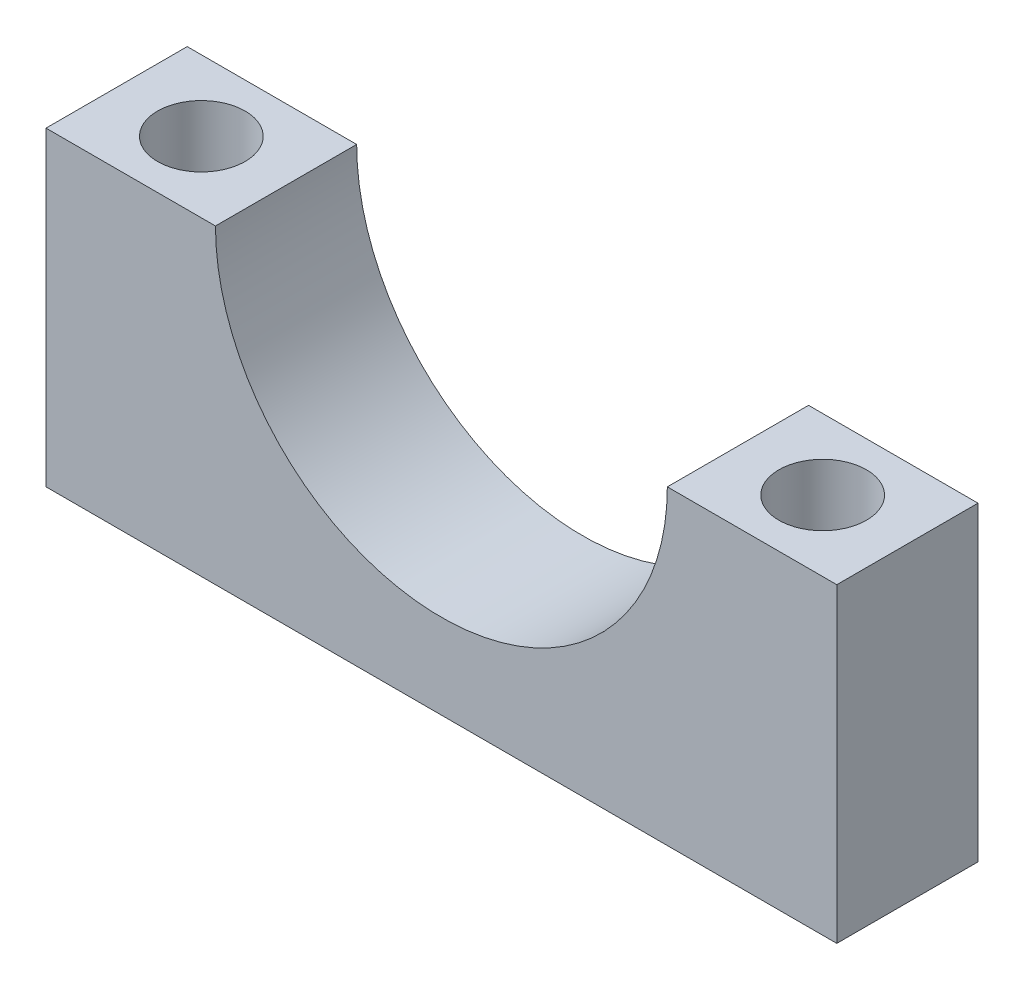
ISO-10303-21;
HEADER;
FILE_DESCRIPTION(('STEP AP214'),'2;1');
FILE_NAME('part.step','',(''),(''),'','','');
FILE_SCHEMA(('AUTOMOTIVE_DESIGN { 1 0 10303 214 1 1 1 1 }'));
ENDSEC;
DATA;
#1=APPLICATION_CONTEXT('core data for automotive mechanical design processes');
#2=APPLICATION_PROTOCOL_DEFINITION('international standard','automotive_design',2000,#1);
#3=PRODUCT_CONTEXT('',#1,'mechanical');
#4=PRODUCT('Part','Part','',(#3));
#5=PRODUCT_RELATED_PRODUCT_CATEGORY('part','',(#4));
#6=PRODUCT_DEFINITION_FORMATION('','',#4);
#7=PRODUCT_DEFINITION_CONTEXT('part definition',#1,'design');
#8=PRODUCT_DEFINITION('design','',#6,#7);
#9=PRODUCT_DEFINITION_SHAPE('','',#8);
#10=(LENGTH_UNIT() NAMED_UNIT(*) SI_UNIT(.MILLI.,.METRE.));
#11=(NAMED_UNIT(*) PLANE_ANGLE_UNIT() SI_UNIT($,.RADIAN.));
#12=(NAMED_UNIT(*) SI_UNIT($,.STERADIAN.) SOLID_ANGLE_UNIT());
#13=UNCERTAINTY_MEASURE_WITH_UNIT(LENGTH_MEASURE(1.E-05),#10,'distance_accuracy_value','');
#14=(GEOMETRIC_REPRESENTATION_CONTEXT(3) GLOBAL_UNCERTAINTY_ASSIGNED_CONTEXT((#13)) GLOBAL_UNIT_ASSIGNED_CONTEXT((#10,
#11,#12)) REPRESENTATION_CONTEXT('',''));
#15=CARTESIAN_POINT('',(0.,0.,0.));
#16=DIRECTION('',(0.,0.,1.));
#17=DIRECTION('',(1.,0.,0.));
#18=AXIS2_PLACEMENT_3D('',#15,#16,#17);
#19=CARTESIAN_POINT('',(14.,-5.5,5.));
#20=DIRECTION('',(-1.,0.,0.));
#21=DIRECTION('',(0.,0.,1.));
#22=AXIS2_PLACEMENT_3D('',#19,#20,#21);
#23=PLANE('',#22);
#24=DIRECTION('',(0.,1.,0.));
#25=VECTOR('',#24,1.);
#26=CARTESIAN_POINT('',(14.,-5.5,0.));
#27=LINE('',#26,#25);
#28=CARTESIAN_POINT('',(14.,-5.5,0.));
#29=VERTEX_POINT('',#28);
#30=CARTESIAN_POINT('',(14.,5.5,0.));
#31=VERTEX_POINT('',#30);
#32=EDGE_CURVE('E128',#29,#31,#27,.T.);
#33=ORIENTED_EDGE('',*,*,#32,.T.);
#34=DIRECTION('',(0.,0.,-1.));
#35=VECTOR('',#34,1.);
#36=CARTESIAN_POINT('',(14.,5.5,5.));
#37=LINE('',#36,#35);
#38=CARTESIAN_POINT('',(14.,5.5,5.));
#39=VERTEX_POINT('',#38);
#40=EDGE_CURVE('E11',#39,#31,#37,.T.);
#41=ORIENTED_EDGE('',*,*,#40,.F.);
#42=DIRECTION('',(0.,1.,0.));
#43=VECTOR('',#42,1.);
#44=CARTESIAN_POINT('',(14.,-5.5,5.));
#45=LINE('',#44,#43);
#46=CARTESIAN_POINT('',(14.,-5.5,5.));
#47=VERTEX_POINT('',#46);
#48=EDGE_CURVE('E145',#47,#39,#45,.T.);
#49=ORIENTED_EDGE('',*,*,#48,.F.);
#50=DIRECTION('',(0.,0.,-1.));
#51=VECTOR('',#50,1.);
#52=CARTESIAN_POINT('',(14.,-5.5,5.));
#53=LINE('',#52,#51);
#54=EDGE_CURVE('E124',#47,#29,#53,.T.);
#55=ORIENTED_EDGE('',*,*,#54,.T.);
#56=EDGE_LOOP('',(#33,#41,#49,#55));
#57=FACE_BOUND('',#56,.T.);
#58=ADVANCED_FACE('F39',(#57),#23,.F.);
#59=CARTESIAN_POINT('',(14.,5.5,5.));
#60=DIRECTION('',(0.,-1.,0.));
#61=DIRECTION('',(0.,0.,-1.));
#62=AXIS2_PLACEMENT_3D('',#59,#60,#61);
#63=PLANE('',#62);
#64=CARTESIAN_POINT('',(11.,5.5,2.5));
#65=DIRECTION('',(0.,-1.,0.));
#66=DIRECTION('',(0.,0.,-1.));
#67=AXIS2_PLACEMENT_3D('',#64,#65,#66);
#68=CIRCLE('',#67,1.55);
#69=CARTESIAN_POINT('',(11.,5.5,0.950000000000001));
#70=VERTEX_POINT('',#69);
#71=EDGE_CURVE('E199',#70,#70,#68,.T.);
#72=ORIENTED_EDGE('',*,*,#71,.T.);
#73=EDGE_LOOP('',(#72));
#74=FACE_BOUND('',#73,.T.);
#75=DIRECTION('',(-1.,0.,0.));
#76=VECTOR('',#75,1.);
#77=CARTESIAN_POINT('',(14.,5.5,0.));
#78=LINE('',#77,#76);
#79=CARTESIAN_POINT('',(8.,5.5,0.));
#80=VERTEX_POINT('',#79);
#81=EDGE_CURVE('E132',#31,#80,#78,.T.);
#82=ORIENTED_EDGE('',*,*,#81,.T.);
#83=DIRECTION('',(0.,0.,-1.));
#84=VECTOR('',#83,1.);
#85=CARTESIAN_POINT('',(8.,5.5,5.));
#86=LINE('',#85,#84);
#87=CARTESIAN_POINT('',(8.,5.5,5.));
#88=VERTEX_POINT('',#87);
#89=EDGE_CURVE('E48',#88,#80,#86,.T.);
#90=ORIENTED_EDGE('',*,*,#89,.F.);
#91=DIRECTION('',(-1.,0.,0.));
#92=VECTOR('',#91,1.);
#93=CARTESIAN_POINT('',(14.,5.5,5.));
#94=LINE('',#93,#92);
#95=EDGE_CURVE('E93',#39,#88,#94,.T.);
#96=ORIENTED_EDGE('',*,*,#95,.F.);
#97=ORIENTED_EDGE('',*,*,#40,.T.);
#98=EDGE_LOOP('',(#82,#90,#96,#97));
#99=FACE_BOUND('',#98,.T.);
#100=ADVANCED_FACE('F176',(#74,#99),#63,.F.);
#101=CARTESIAN_POINT('',(0.,5.5,5.));
#102=DIRECTION('',(0.,0.,-1.));
#103=DIRECTION('',(-1.,0.,0.));
#104=AXIS2_PLACEMENT_3D('',#101,#102,#103);
#105=CYLINDRICAL_SURFACE('',#104,8.);
#106=CARTESIAN_POINT('',(0.,5.5,0.));
#107=DIRECTION('',(0.,0.,-1.));
#108=DIRECTION('',(-1.,0.,0.));
#109=AXIS2_PLACEMENT_3D('',#106,#107,#108);
#110=CIRCLE('',#109,8.);
#111=CARTESIAN_POINT('',(-8.,5.5,0.));
#112=VERTEX_POINT('',#111);
#113=EDGE_CURVE('E136',#80,#112,#110,.T.);
#114=ORIENTED_EDGE('',*,*,#113,.T.);
#115=DIRECTION('',(0.,0.,-1.));
#116=VECTOR('',#115,1.);
#117=CARTESIAN_POINT('',(-8.,5.5,5.));
#118=LINE('',#117,#116);
#119=CARTESIAN_POINT('',(-8.,5.5,5.));
#120=VERTEX_POINT('',#119);
#121=EDGE_CURVE('E117',#120,#112,#118,.T.);
#122=ORIENTED_EDGE('',*,*,#121,.F.);
#123=CARTESIAN_POINT('',(0.,5.5,5.));
#124=DIRECTION('',(0.,0.,-1.));
#125=DIRECTION('',(-1.,0.,0.));
#126=AXIS2_PLACEMENT_3D('',#123,#124,#125);
#127=CIRCLE('',#126,8.);
#128=EDGE_CURVE('E106',#88,#120,#127,.T.);
#129=ORIENTED_EDGE('',*,*,#128,.F.);
#130=ORIENTED_EDGE('',*,*,#89,.T.);
#131=EDGE_LOOP('',(#114,#122,#129,#130));
#132=FACE_BOUND('',#131,.T.);
#133=ADVANCED_FACE('F155',(#132),#105,.F.);
#134=CARTESIAN_POINT('',(-8.,5.5,5.));
#135=DIRECTION('',(0.,-1.,0.));
#136=DIRECTION('',(0.,0.,-1.));
#137=AXIS2_PLACEMENT_3D('',#134,#135,#136);
#138=PLANE('',#137);
#139=CARTESIAN_POINT('',(-11.,5.5,2.5));
#140=DIRECTION('',(0.,-1.,0.));
#141=DIRECTION('',(0.,0.,-1.));
#142=AXIS2_PLACEMENT_3D('',#139,#140,#141);
#143=CIRCLE('',#142,1.55);
#144=CARTESIAN_POINT('',(-11.,5.5,0.950000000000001));
#145=VERTEX_POINT('',#144);
#146=EDGE_CURVE('E133',#145,#145,#143,.T.);
#147=ORIENTED_EDGE('',*,*,#146,.T.);
#148=EDGE_LOOP('',(#147));
#149=FACE_BOUND('',#148,.T.);
#150=DIRECTION('',(-1.,0.,0.));
#151=VECTOR('',#150,1.);
#152=CARTESIAN_POINT('',(-8.,5.5,0.));
#153=LINE('',#152,#151);
#154=CARTESIAN_POINT('',(-14.,5.5,0.));
#155=VERTEX_POINT('',#154);
#156=EDGE_CURVE('E115',#112,#155,#153,.T.);
#157=ORIENTED_EDGE('',*,*,#156,.T.);
#158=DIRECTION('',(0.,0.,-1.));
#159=VECTOR('',#158,1.);
#160=CARTESIAN_POINT('',(-14.,5.5,5.));
#161=LINE('',#160,#159);
#162=CARTESIAN_POINT('',(-14.,5.5,5.));
#163=VERTEX_POINT('',#162);
#164=EDGE_CURVE('E112',#163,#155,#161,.T.);
#165=ORIENTED_EDGE('',*,*,#164,.F.);
#166=DIRECTION('',(-1.,0.,0.));
#167=VECTOR('',#166,1.);
#168=CARTESIAN_POINT('',(-8.,5.5,5.));
#169=LINE('',#168,#167);
#170=EDGE_CURVE('E100',#120,#163,#169,.T.);
#171=ORIENTED_EDGE('',*,*,#170,.F.);
#172=ORIENTED_EDGE('',*,*,#121,.T.);
#173=EDGE_LOOP('',(#157,#165,#171,#172));
#174=FACE_BOUND('',#173,.T.);
#175=ADVANCED_FACE('F113',(#149,#174),#138,.F.);
#176=CARTESIAN_POINT('',(-14.,5.5,5.));
#177=DIRECTION('',(1.,0.,0.));
#178=DIRECTION('',(0.,1.,0.));
#179=AXIS2_PLACEMENT_3D('',#176,#177,#178);
#180=PLANE('',#179);
#181=DIRECTION('',(0.,-1.,0.));
#182=VECTOR('',#181,1.);
#183=CARTESIAN_POINT('',(-14.,5.5,0.));
#184=LINE('',#183,#182);
#185=CARTESIAN_POINT('',(-14.,-5.5,0.));
#186=VERTEX_POINT('',#185);
#187=EDGE_CURVE('E79',#155,#186,#184,.T.);
#188=ORIENTED_EDGE('',*,*,#187,.T.);
#189=DIRECTION('',(0.,0.,-1.));
#190=VECTOR('',#189,1.);
#191=CARTESIAN_POINT('',(-14.,-5.5,5.));
#192=LINE('',#191,#190);
#193=CARTESIAN_POINT('',(-14.,-5.5,5.));
#194=VERTEX_POINT('',#193);
#195=EDGE_CURVE('E118',#194,#186,#192,.T.);
#196=ORIENTED_EDGE('',*,*,#195,.F.);
#197=DIRECTION('',(0.,-1.,0.));
#198=VECTOR('',#197,1.);
#199=CARTESIAN_POINT('',(-14.,5.5,5.));
#200=LINE('',#199,#198);
#201=EDGE_CURVE('E104',#163,#194,#200,.T.);
#202=ORIENTED_EDGE('',*,*,#201,.F.);
#203=ORIENTED_EDGE('',*,*,#164,.T.);
#204=EDGE_LOOP('',(#188,#196,#202,#203));
#205=FACE_BOUND('',#204,.T.);
#206=ADVANCED_FACE('F120',(#205),#180,.F.);
#207=CARTESIAN_POINT('',(-14.,-5.5,5.));
#208=DIRECTION('',(0.,1.,0.));
#209=DIRECTION('',(0.,0.,1.));
#210=AXIS2_PLACEMENT_3D('',#207,#208,#209);
#211=PLANE('',#210);
#212=CARTESIAN_POINT('',(-11.,-5.5,2.5));
#213=DIRECTION('',(0.,-1.,0.));
#214=DIRECTION('',(0.,0.,-1.));
#215=AXIS2_PLACEMENT_3D('',#212,#213,#214);
#216=CIRCLE('',#215,1.55);
#217=CARTESIAN_POINT('',(-11.,-5.5,0.950000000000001));
#218=VERTEX_POINT('',#217);
#219=EDGE_CURVE('E195',#218,#218,#216,.T.);
#220=ORIENTED_EDGE('',*,*,#219,.F.);
#221=EDGE_LOOP('',(#220));
#222=FACE_BOUND('',#221,.T.);
#223=CARTESIAN_POINT('',(11.,-5.5,2.5));
#224=DIRECTION('',(0.,-1.,0.));
#225=DIRECTION('',(0.,0.,-1.));
#226=AXIS2_PLACEMENT_3D('',#223,#224,#225);
#227=CIRCLE('',#226,1.55);
#228=CARTESIAN_POINT('',(11.,-5.5,0.950000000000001));
#229=VERTEX_POINT('',#228);
#230=EDGE_CURVE('E204',#229,#229,#227,.T.);
#231=ORIENTED_EDGE('',*,*,#230,.F.);
#232=EDGE_LOOP('',(#231));
#233=FACE_BOUND('',#232,.T.);
#234=DIRECTION('',(1.,0.,0.));
#235=VECTOR('',#234,1.);
#236=CARTESIAN_POINT('',(-14.,-5.5,0.));
#237=LINE('',#236,#235);
#238=EDGE_CURVE('E85',#186,#29,#237,.T.);
#239=ORIENTED_EDGE('',*,*,#238,.T.);
#240=ORIENTED_EDGE('',*,*,#54,.F.);
#241=DIRECTION('',(1.,0.,0.));
#242=VECTOR('',#241,1.);
#243=CARTESIAN_POINT('',(-14.,-5.5,5.));
#244=LINE('',#243,#242);
#245=EDGE_CURVE('E56',#194,#47,#244,.T.);
#246=ORIENTED_EDGE('',*,*,#245,.F.);
#247=ORIENTED_EDGE('',*,*,#195,.T.);
#248=EDGE_LOOP('',(#239,#240,#246,#247));
#249=FACE_BOUND('',#248,.T.);
#250=ADVANCED_FACE('F162',(#222,#233,#249),#211,.F.);
#251=CARTESIAN_POINT('',(0.,5.5,5.));
#252=DIRECTION('',(0.,0.,-1.));
#253=DIRECTION('',(-1.,0.,0.));
#254=AXIS2_PLACEMENT_3D('',#251,#252,#253);
#255=PLANE('',#254);
#256=ORIENTED_EDGE('',*,*,#48,.T.);
#257=ORIENTED_EDGE('',*,*,#95,.T.);
#258=ORIENTED_EDGE('',*,*,#128,.T.);
#259=ORIENTED_EDGE('',*,*,#170,.T.);
#260=ORIENTED_EDGE('',*,*,#201,.T.);
#261=ORIENTED_EDGE('',*,*,#245,.T.);
#262=EDGE_LOOP('',(#256,#257,#258,#259,#260,#261));
#263=FACE_BOUND('',#262,.T.);
#264=ADVANCED_FACE('F102',(#263),#255,.F.);
#265=CARTESIAN_POINT('',(0.,5.5,0.));
#266=DIRECTION('',(0.,0.,-1.));
#267=DIRECTION('',(-1.,0.,0.));
#268=AXIS2_PLACEMENT_3D('',#265,#266,#267);
#269=PLANE('',#268);
#270=ORIENTED_EDGE('',*,*,#32,.F.);
#271=ORIENTED_EDGE('',*,*,#238,.F.);
#272=ORIENTED_EDGE('',*,*,#187,.F.);
#273=ORIENTED_EDGE('',*,*,#156,.F.);
#274=ORIENTED_EDGE('',*,*,#113,.F.);
#275=ORIENTED_EDGE('',*,*,#81,.F.);
#276=EDGE_LOOP('',(#270,#271,#272,#273,#274,#275));
#277=FACE_BOUND('',#276,.T.);
#278=ADVANCED_FACE('F158',(#277),#269,.T.);
#279=CARTESIAN_POINT('',(11.,5.5,2.5));
#280=DIRECTION('',(0.,-1.,0.));
#281=DIRECTION('',(0.,0.,-1.));
#282=AXIS2_PLACEMENT_3D('',#279,#280,#281);
#283=CYLINDRICAL_SURFACE('',#282,1.55);
#284=ORIENTED_EDGE('',*,*,#71,.F.);
#285=EDGE_LOOP('',(#284));
#286=FACE_BOUND('',#285,.T.);
#287=ORIENTED_EDGE('',*,*,#230,.T.);
#288=EDGE_LOOP('',(#287));
#289=FACE_BOUND('',#288,.T.);
#290=ADVANCED_FACE('F214',(#286,#289),#283,.F.);
#291=CARTESIAN_POINT('',(-11.,5.5,2.5));
#292=DIRECTION('',(0.,-1.,0.));
#293=DIRECTION('',(0.,0.,-1.));
#294=AXIS2_PLACEMENT_3D('',#291,#292,#293);
#295=CYLINDRICAL_SURFACE('',#294,1.55);
#296=ORIENTED_EDGE('',*,*,#146,.F.);
#297=EDGE_LOOP('',(#296));
#298=FACE_BOUND('',#297,.T.);
#299=ORIENTED_EDGE('',*,*,#219,.T.);
#300=EDGE_LOOP('',(#299));
#301=FACE_BOUND('',#300,.T.);
#302=ADVANCED_FACE('F216',(#298,#301),#295,.F.);
#303=CLOSED_SHELL('',(#58,#100,#133,#175,#206,#250,#264,#278,#290,#302));
#304=MANIFOLD_SOLID_BREP('B2',#303);
#305=ADVANCED_BREP_SHAPE_REPRESENTATION('',(#18,#304),#14);
#306=SHAPE_DEFINITION_REPRESENTATION(#9,#305);
ENDSEC;
END-ISO-10303-21;
